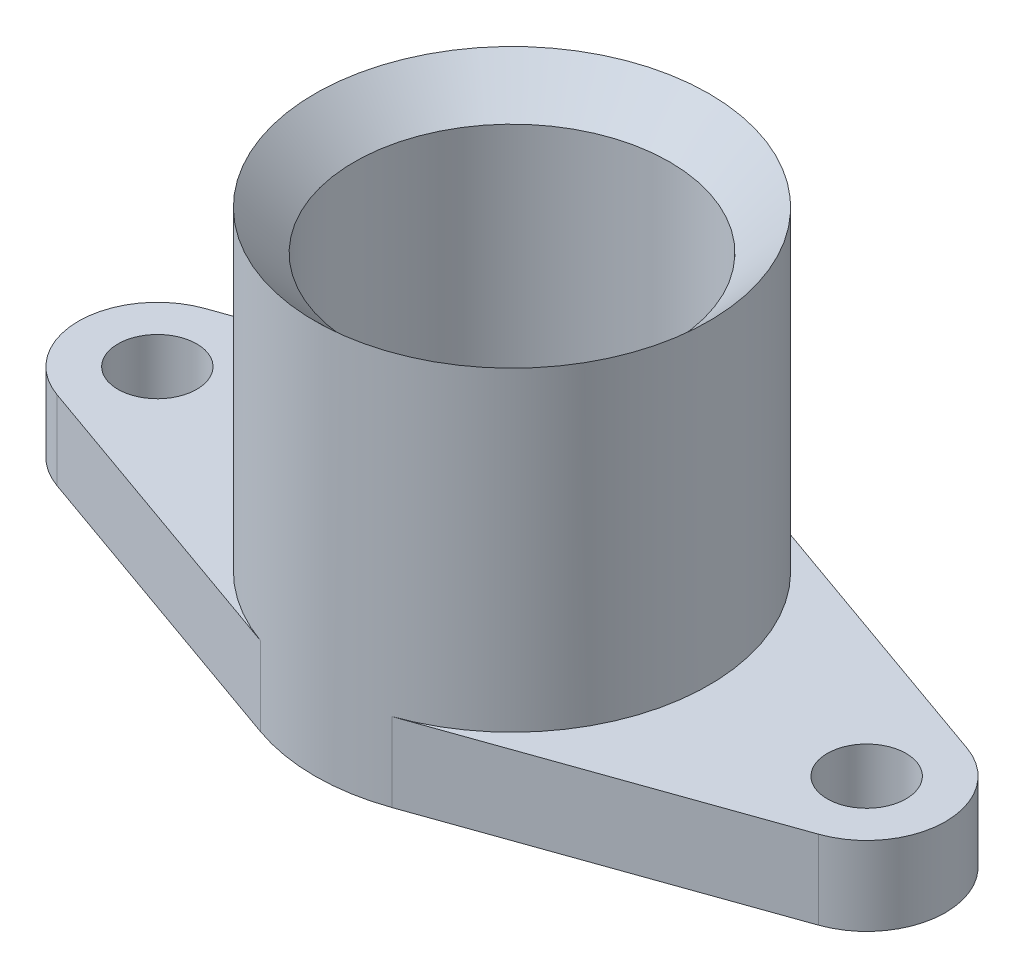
ISO-10303-21;
HEADER;
FILE_DESCRIPTION(('STEP AP214'),'2;1');
FILE_NAME('part.step','',(''),(''),'','','');
FILE_SCHEMA(('AUTOMOTIVE_DESIGN { 1 0 10303 214 1 1 1 1 }'));
ENDSEC;
DATA;
#1=APPLICATION_CONTEXT('core data for automotive mechanical design processes');
#2=APPLICATION_PROTOCOL_DEFINITION('international standard','automotive_design',2000,#1);
#3=PRODUCT_CONTEXT('',#1,'mechanical');
#4=PRODUCT('Part','Part','',(#3));
#5=PRODUCT_RELATED_PRODUCT_CATEGORY('part','',(#4));
#6=PRODUCT_DEFINITION_FORMATION('','',#4);
#7=PRODUCT_DEFINITION_CONTEXT('part definition',#1,'design');
#8=PRODUCT_DEFINITION('design','',#6,#7);
#9=PRODUCT_DEFINITION_SHAPE('','',#8);
#10=(LENGTH_UNIT() NAMED_UNIT(*) SI_UNIT(.MILLI.,.METRE.));
#11=(NAMED_UNIT(*) PLANE_ANGLE_UNIT() SI_UNIT($,.RADIAN.));
#12=(NAMED_UNIT(*) SI_UNIT($,.STERADIAN.) SOLID_ANGLE_UNIT());
#13=UNCERTAINTY_MEASURE_WITH_UNIT(LENGTH_MEASURE(1.E-05),#10,'distance_accuracy_value','');
#14=(GEOMETRIC_REPRESENTATION_CONTEXT(3) GLOBAL_UNCERTAINTY_ASSIGNED_CONTEXT((#13)) GLOBAL_UNIT_ASSIGNED_CONTEXT((#10,
#11,#12)) REPRESENTATION_CONTEXT('',''));
#15=CARTESIAN_POINT('',(0.,0.,0.));
#16=DIRECTION('',(0.,0.,1.));
#17=DIRECTION('',(1.,0.,0.));
#18=AXIS2_PLACEMENT_3D('',#15,#16,#17);
#19=CARTESIAN_POINT('',(0.,-73.0614942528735,0.));
#20=DIRECTION('',(0.,-1.,0.));
#21=DIRECTION('',(0.,0.,-1.));
#22=AXIS2_PLACEMENT_3D('',#19,#20,#21);
#23=CYLINDRICAL_SURFACE('',#22,50.);
#24=CARTESIAN_POINT('',(0.,100.,0.));
#25=DIRECTION('',(0.,-1.,0.));
#26=DIRECTION('',(0.,0.,-1.));
#27=AXIS2_PLACEMENT_3D('',#24,#25,#26);
#28=CIRCLE('',#27,50.);
#29=CARTESIAN_POINT('',(0.,100.,-50.));
#30=VERTEX_POINT('',#29);
#31=EDGE_CURVE('E175',#30,#30,#28,.T.);
#32=ORIENTED_EDGE('',*,*,#31,.T.);
#33=EDGE_LOOP('',(#32));
#34=FACE_BOUND('',#33,.T.);
#35=DIRECTION('',(0.,-1.,0.));
#36=VECTOR('',#35,1.);
#37=CARTESIAN_POINT('',(16.6666666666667,20.,47.1404520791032));
#38=LINE('',#37,#36);
#39=CARTESIAN_POINT('',(16.6666666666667,20.,47.1404520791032));
#40=VERTEX_POINT('',#39);
#41=CARTESIAN_POINT('',(16.6666666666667,0.,47.1404520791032));
#42=VERTEX_POINT('',#41);
#43=EDGE_CURVE('E46',#40,#42,#38,.T.);
#44=ORIENTED_EDGE('',*,*,#43,.F.);
#45=CARTESIAN_POINT('',(0.,20.,0.));
#46=DIRECTION('',(0.,-1.,0.));
#47=DIRECTION('',(0.,0.,-1.));
#48=AXIS2_PLACEMENT_3D('',#45,#46,#47);
#49=CIRCLE('',#48,50.);
#50=CARTESIAN_POINT('',(16.6666666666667,20.,-47.1404520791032));
#51=VERTEX_POINT('',#50);
#52=EDGE_CURVE('E103',#51,#40,#49,.T.);
#53=ORIENTED_EDGE('',*,*,#52,.F.);
#54=DIRECTION('',(0.,-1.,0.));
#55=VECTOR('',#54,1.);
#56=CARTESIAN_POINT('',(16.6666666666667,20.,-47.1404520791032));
#57=LINE('',#56,#55);
#58=CARTESIAN_POINT('',(16.6666666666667,0.,-47.1404520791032));
#59=VERTEX_POINT('',#58);
#60=EDGE_CURVE('E111',#51,#59,#57,.T.);
#61=ORIENTED_EDGE('',*,*,#60,.T.);
#62=CARTESIAN_POINT('',(0.,0.,0.));
#63=DIRECTION('',(0.,-1.,0.));
#64=DIRECTION('',(0.,0.,-1.));
#65=AXIS2_PLACEMENT_3D('',#62,#63,#64);
#66=CIRCLE('',#65,50.);
#67=CARTESIAN_POINT('',(-16.6666666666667,0.,-47.1404520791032));
#68=VERTEX_POINT('',#67);
#69=EDGE_CURVE('E173',#68,#59,#66,.T.);
#70=ORIENTED_EDGE('',*,*,#69,.F.);
#71=DIRECTION('',(0.,-1.,0.));
#72=VECTOR('',#71,1.);
#73=CARTESIAN_POINT('',(-16.6666666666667,20.,-47.1404520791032));
#74=LINE('',#73,#72);
#75=CARTESIAN_POINT('',(-16.6666666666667,20.,-47.1404520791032));
#76=VERTEX_POINT('',#75);
#77=EDGE_CURVE('E164',#76,#68,#74,.T.);
#78=ORIENTED_EDGE('',*,*,#77,.F.);
#79=CARTESIAN_POINT('',(0.,20.,0.));
#80=DIRECTION('',(0.,1.,0.));
#81=DIRECTION('',(0.,0.,-1.));
#82=AXIS2_PLACEMENT_3D('',#79,#80,#81);
#83=CIRCLE('',#82,50.);
#84=CARTESIAN_POINT('',(-16.6666666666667,20.,47.1404520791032));
#85=VERTEX_POINT('',#84);
#86=EDGE_CURVE('E146',#76,#85,#83,.T.);
#87=ORIENTED_EDGE('',*,*,#86,.T.);
#88=DIRECTION('',(0.,-1.,0.));
#89=VECTOR('',#88,1.);
#90=CARTESIAN_POINT('',(-16.6666666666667,20.,47.1404520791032));
#91=LINE('',#90,#89);
#92=CARTESIAN_POINT('',(-16.6666666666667,0.,47.1404520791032));
#93=VERTEX_POINT('',#92);
#94=EDGE_CURVE('E158',#85,#93,#91,.T.);
#95=ORIENTED_EDGE('',*,*,#94,.T.);
#96=EDGE_CURVE('E166',#42,#93,#66,.T.);
#97=ORIENTED_EDGE('',*,*,#96,.F.);
#98=EDGE_LOOP('',(#44,#53,#61,#70,#78,#87,#95,#97));
#99=FACE_BOUND('',#98,.T.);
#100=ADVANCED_FACE('F31',(#34,#99),#23,.T.);
#101=CARTESIAN_POINT('',(-40.,0.,0.));
#102=DIRECTION('',(0.,1.,0.));
#103=DIRECTION('',(0.,0.,1.));
#104=AXIS2_PLACEMENT_3D('',#101,#102,#103);
#105=PLANE('',#104);
#106=CARTESIAN_POINT('',(0.,0.,0.));
#107=DIRECTION('',(0.,-1.,0.));
#108=DIRECTION('',(0.,0.,-1.));
#109=AXIS2_PLACEMENT_3D('',#106,#107,#108);
#110=CIRCLE('',#109,40.);
#111=CARTESIAN_POINT('',(0.,0.,-40.));
#112=VERTEX_POINT('',#111);
#113=EDGE_CURVE('E11',#112,#112,#110,.T.);
#114=ORIENTED_EDGE('',*,*,#113,.F.);
#115=EDGE_LOOP('',(#114));
#116=FACE_BOUND('',#115,.T.);
#117=ORIENTED_EDGE('',*,*,#69,.T.);
#118=DIRECTION('',(-0.942809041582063,0.,-0.333333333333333));
#119=VECTOR('',#118,1.);
#120=CARTESIAN_POINT('',(16.6666666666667,0.,-47.1404520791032));
#121=LINE('',#120,#119);
#122=CARTESIAN_POINT('',(96.6666666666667,0.,-18.8561808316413));
#123=VERTEX_POINT('',#122);
#124=EDGE_CURVE('E114',#123,#59,#121,.T.);
#125=ORIENTED_EDGE('',*,*,#124,.F.);
#126=CARTESIAN_POINT('',(90.,0.,0.));
#127=DIRECTION('',(0.,1.,0.));
#128=DIRECTION('',(0.,0.,-1.));
#129=AXIS2_PLACEMENT_3D('',#126,#127,#128);
#130=CIRCLE('',#129,20.);
#131=CARTESIAN_POINT('',(96.6666666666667,0.,18.8561808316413));
#132=VERTEX_POINT('',#131);
#133=EDGE_CURVE('E123',#132,#123,#130,.T.);
#134=ORIENTED_EDGE('',*,*,#133,.F.);
#135=DIRECTION('',(0.942809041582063,0.,-0.333333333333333));
#136=VECTOR('',#135,1.);
#137=CARTESIAN_POINT('',(16.6666666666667,0.,47.1404520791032));
#138=LINE('',#137,#136);
#139=EDGE_CURVE('E121',#42,#132,#138,.T.);
#140=ORIENTED_EDGE('',*,*,#139,.F.);
#141=ORIENTED_EDGE('',*,*,#96,.T.);
#142=DIRECTION('',(-0.942809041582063,0.,-0.333333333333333));
#143=VECTOR('',#142,1.);
#144=CARTESIAN_POINT('',(-16.6666666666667,0.,47.1404520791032));
#145=LINE('',#144,#143);
#146=CARTESIAN_POINT('',(-96.6666666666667,0.,18.8561808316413));
#147=VERTEX_POINT('',#146);
#148=EDGE_CURVE('E143',#93,#147,#145,.T.);
#149=ORIENTED_EDGE('',*,*,#148,.T.);
#150=CARTESIAN_POINT('',(-90.,0.,0.));
#151=DIRECTION('',(0.,-1.,0.));
#152=DIRECTION('',(0.,0.,-1.));
#153=AXIS2_PLACEMENT_3D('',#150,#151,#152);
#154=CIRCLE('',#153,20.);
#155=CARTESIAN_POINT('',(-96.6666666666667,0.,-18.8561808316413));
#156=VERTEX_POINT('',#155);
#157=EDGE_CURVE('E161',#147,#156,#154,.T.);
#158=ORIENTED_EDGE('',*,*,#157,.T.);
#159=DIRECTION('',(0.942809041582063,0.,-0.333333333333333));
#160=VECTOR('',#159,1.);
#161=CARTESIAN_POINT('',(-16.6666666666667,0.,-47.1404520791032));
#162=LINE('',#161,#160);
#163=EDGE_CURVE('E54',#156,#68,#162,.T.);
#164=ORIENTED_EDGE('',*,*,#163,.T.);
#165=EDGE_LOOP('',(#117,#125,#134,#140,#141,#149,#158,#164));
#166=FACE_BOUND('',#165,.T.);
#167=CARTESIAN_POINT('',(-90.,0.,0.));
#168=DIRECTION('',(0.,-1.,0.));
#169=DIRECTION('',(0.,0.,-1.));
#170=AXIS2_PLACEMENT_3D('',#167,#168,#169);
#171=CIRCLE('',#170,9.99999999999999);
#172=CARTESIAN_POINT('',(-90.,0.,-9.99999999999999));
#173=VERTEX_POINT('',#172);
#174=EDGE_CURVE('E135',#173,#173,#171,.T.);
#175=ORIENTED_EDGE('',*,*,#174,.F.);
#176=EDGE_LOOP('',(#175));
#177=FACE_BOUND('',#176,.T.);
#178=CARTESIAN_POINT('',(90.,0.,0.));
#179=DIRECTION('',(0.,1.,0.));
#180=DIRECTION('',(0.,0.,-1.));
#181=AXIS2_PLACEMENT_3D('',#178,#179,#180);
#182=CIRCLE('',#181,9.99999999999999);
#183=CARTESIAN_POINT('',(90.,0.,-9.99999999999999));
#184=VERTEX_POINT('',#183);
#185=EDGE_CURVE('E126',#184,#184,#182,.T.);
#186=ORIENTED_EDGE('',*,*,#185,.T.);
#187=EDGE_LOOP('',(#186));
#188=FACE_BOUND('',#187,.T.);
#189=ADVANCED_FACE('F33',(#116,#166,#177,#188),#105,.F.);
#190=CARTESIAN_POINT('',(0.,-73.0614942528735,0.));
#191=DIRECTION('',(0.,-1.,0.));
#192=DIRECTION('',(0.,0.,-1.));
#193=AXIS2_PLACEMENT_3D('',#190,#191,#192);
#194=CYLINDRICAL_SURFACE('',#193,40.);
#195=CARTESIAN_POINT('',(0.,90.,0.));
#196=DIRECTION('',(0.,-1.,0.));
#197=DIRECTION('',(0.,0.,-1.));
#198=AXIS2_PLACEMENT_3D('',#195,#196,#197);
#199=CIRCLE('',#198,40.);
#200=CARTESIAN_POINT('',(0.,90.,-40.));
#201=VERTEX_POINT('',#200);
#202=EDGE_CURVE('E39',#201,#201,#199,.T.);
#203=ORIENTED_EDGE('',*,*,#202,.F.);
#204=EDGE_LOOP('',(#203));
#205=FACE_BOUND('',#204,.T.);
#206=ORIENTED_EDGE('',*,*,#113,.T.);
#207=EDGE_LOOP('',(#206));
#208=FACE_BOUND('',#207,.T.);
#209=ADVANCED_FACE('F182',(#205,#208),#194,.F.);
#210=CARTESIAN_POINT('',(0.,90.,0.));
#211=DIRECTION('',(0.,1.,0.));
#212=DIRECTION('',(0.,0.,1.));
#213=AXIS2_PLACEMENT_3D('',#210,#211,#212);
#214=CONICAL_SURFACE('',#213,40.,0.785398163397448);
#215=ORIENTED_EDGE('',*,*,#31,.F.);
#216=EDGE_LOOP('',(#215));
#217=FACE_BOUND('',#216,.T.);
#218=ORIENTED_EDGE('',*,*,#202,.T.);
#219=EDGE_LOOP('',(#218));
#220=FACE_BOUND('',#219,.T.);
#221=ADVANCED_FACE('F180',(#217,#220),#214,.F.);
#222=CARTESIAN_POINT('',(-16.6666666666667,20.,-47.1404520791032));
#223=DIRECTION('',(-0.333333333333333,0.,-0.942809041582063));
#224=DIRECTION('',(-0.942809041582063,0.,0.333333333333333));
#225=AXIS2_PLACEMENT_3D('',#222,#223,#224);
#226=PLANE('',#225);
#227=ORIENTED_EDGE('',*,*,#163,.F.);
#228=DIRECTION('',(0.,-1.,0.));
#229=VECTOR('',#228,1.);
#230=CARTESIAN_POINT('',(-96.6666666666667,20.,-18.8561808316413));
#231=LINE('',#230,#229);
#232=CARTESIAN_POINT('',(-96.6666666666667,20.,-18.8561808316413));
#233=VERTEX_POINT('',#232);
#234=EDGE_CURVE('E167',#233,#156,#231,.T.);
#235=ORIENTED_EDGE('',*,*,#234,.F.);
#236=DIRECTION('',(0.942809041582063,0.,-0.333333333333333));
#237=VECTOR('',#236,1.);
#238=CARTESIAN_POINT('',(-16.6666666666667,20.,-47.1404520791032));
#239=LINE('',#238,#237);
#240=EDGE_CURVE('E155',#233,#76,#239,.T.);
#241=ORIENTED_EDGE('',*,*,#240,.T.);
#242=ORIENTED_EDGE('',*,*,#77,.T.);
#243=EDGE_LOOP('',(#227,#235,#241,#242));
#244=FACE_BOUND('',#243,.T.);
#245=ADVANCED_FACE('F222',(#244),#226,.T.);
#246=CARTESIAN_POINT('',(-90.,20.,0.));
#247=DIRECTION('',(0.,-1.,0.));
#248=DIRECTION('',(0.,0.,-1.));
#249=AXIS2_PLACEMENT_3D('',#246,#247,#248);
#250=CYLINDRICAL_SURFACE('',#249,20.);
#251=ORIENTED_EDGE('',*,*,#157,.F.);
#252=DIRECTION('',(0.,-1.,0.));
#253=VECTOR('',#252,1.);
#254=CARTESIAN_POINT('',(-96.6666666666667,20.,18.8561808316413));
#255=LINE('',#254,#253);
#256=CARTESIAN_POINT('',(-96.6666666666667,20.,18.8561808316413));
#257=VERTEX_POINT('',#256);
#258=EDGE_CURVE('E169',#257,#147,#255,.T.);
#259=ORIENTED_EDGE('',*,*,#258,.F.);
#260=CARTESIAN_POINT('',(-90.,20.,0.));
#261=DIRECTION('',(0.,-1.,0.));
#262=DIRECTION('',(0.,0.,-1.));
#263=AXIS2_PLACEMENT_3D('',#260,#261,#262);
#264=CIRCLE('',#263,20.);
#265=EDGE_CURVE('E152',#257,#233,#264,.T.);
#266=ORIENTED_EDGE('',*,*,#265,.T.);
#267=ORIENTED_EDGE('',*,*,#234,.T.);
#268=EDGE_LOOP('',(#251,#259,#266,#267));
#269=FACE_BOUND('',#268,.T.);
#270=ADVANCED_FACE('F227',(#269),#250,.T.);
#271=CARTESIAN_POINT('',(-16.6666666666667,20.,47.1404520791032));
#272=DIRECTION('',(-0.333333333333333,0.,0.942809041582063));
#273=DIRECTION('',(0.942809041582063,0.,0.333333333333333));
#274=AXIS2_PLACEMENT_3D('',#271,#272,#273);
#275=PLANE('',#274);
#276=ORIENTED_EDGE('',*,*,#148,.F.);
#277=ORIENTED_EDGE('',*,*,#94,.F.);
#278=DIRECTION('',(-0.942809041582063,0.,-0.333333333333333));
#279=VECTOR('',#278,1.);
#280=CARTESIAN_POINT('',(-16.6666666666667,20.,47.1404520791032));
#281=LINE('',#280,#279);
#282=EDGE_CURVE('E149',#85,#257,#281,.T.);
#283=ORIENTED_EDGE('',*,*,#282,.T.);
#284=ORIENTED_EDGE('',*,*,#258,.T.);
#285=EDGE_LOOP('',(#276,#277,#283,#284));
#286=FACE_BOUND('',#285,.T.);
#287=ADVANCED_FACE('F219',(#286),#275,.T.);
#288=CARTESIAN_POINT('',(0.,20.,0.));
#289=DIRECTION('',(0.,-1.,0.));
#290=DIRECTION('',(0.,0.,-1.));
#291=AXIS2_PLACEMENT_3D('',#288,#289,#290);
#292=PLANE('',#291);
#293=CARTESIAN_POINT('',(-90.,20.,0.));
#294=DIRECTION('',(0.,-1.,0.));
#295=DIRECTION('',(0.,0.,-1.));
#296=AXIS2_PLACEMENT_3D('',#293,#294,#295);
#297=CIRCLE('',#296,9.99999999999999);
#298=CARTESIAN_POINT('',(-90.,20.,-9.99999999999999));
#299=VERTEX_POINT('',#298);
#300=EDGE_CURVE('E140',#299,#299,#297,.T.);
#301=ORIENTED_EDGE('',*,*,#300,.T.);
#302=EDGE_LOOP('',(#301));
#303=FACE_BOUND('',#302,.T.);
#304=ORIENTED_EDGE('',*,*,#86,.F.);
#305=ORIENTED_EDGE('',*,*,#240,.F.);
#306=ORIENTED_EDGE('',*,*,#265,.F.);
#307=ORIENTED_EDGE('',*,*,#282,.F.);
#308=EDGE_LOOP('',(#304,#305,#306,#307));
#309=FACE_BOUND('',#308,.T.);
#310=ADVANCED_FACE('F208',(#303,#309),#292,.F.);
#311=CARTESIAN_POINT('',(-90.,20.,0.));
#312=DIRECTION('',(0.,-1.,0.));
#313=DIRECTION('',(0.,0.,-1.));
#314=AXIS2_PLACEMENT_3D('',#311,#312,#313);
#315=CYLINDRICAL_SURFACE('',#314,9.99999999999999);
#316=ORIENTED_EDGE('',*,*,#300,.F.);
#317=EDGE_LOOP('',(#316));
#318=FACE_BOUND('',#317,.T.);
#319=ORIENTED_EDGE('',*,*,#174,.T.);
#320=EDGE_LOOP('',(#319));
#321=FACE_BOUND('',#320,.T.);
#322=ADVANCED_FACE('F200',(#318,#321),#315,.F.);
#323=CARTESIAN_POINT('',(0.,20.,0.));
#324=DIRECTION('',(0.,-1.,0.));
#325=DIRECTION('',(0.,0.,-1.));
#326=AXIS2_PLACEMENT_3D('',#323,#324,#325);
#327=PLANE('',#326);
#328=ORIENTED_EDGE('',*,*,#52,.T.);
#329=DIRECTION('',(0.942809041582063,0.,-0.333333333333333));
#330=VECTOR('',#329,1.);
#331=CARTESIAN_POINT('',(16.6666666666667,20.,47.1404520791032));
#332=LINE('',#331,#330);
#333=CARTESIAN_POINT('',(96.6666666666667,20.,18.8561808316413));
#334=VERTEX_POINT('',#333);
#335=EDGE_CURVE('E118',#40,#334,#332,.T.);
#336=ORIENTED_EDGE('',*,*,#335,.T.);
#337=CARTESIAN_POINT('',(90.,20.,0.));
#338=DIRECTION('',(0.,1.,0.));
#339=DIRECTION('',(0.,0.,-1.));
#340=AXIS2_PLACEMENT_3D('',#337,#338,#339);
#341=CIRCLE('',#340,20.);
#342=CARTESIAN_POINT('',(96.6666666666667,20.,-18.8561808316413));
#343=VERTEX_POINT('',#342);
#344=EDGE_CURVE('E105',#334,#343,#341,.T.);
#345=ORIENTED_EDGE('',*,*,#344,.T.);
#346=DIRECTION('',(-0.942809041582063,0.,-0.333333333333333));
#347=VECTOR('',#346,1.);
#348=CARTESIAN_POINT('',(16.6666666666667,20.,-47.1404520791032));
#349=LINE('',#348,#347);
#350=EDGE_CURVE('E98',#343,#51,#349,.T.);
#351=ORIENTED_EDGE('',*,*,#350,.T.);
#352=EDGE_LOOP('',(#328,#336,#345,#351));
#353=FACE_BOUND('',#352,.T.);
#354=CARTESIAN_POINT('',(90.,20.,0.));
#355=DIRECTION('',(0.,1.,0.));
#356=DIRECTION('',(0.,0.,-1.));
#357=AXIS2_PLACEMENT_3D('',#354,#355,#356);
#358=CIRCLE('',#357,9.99999999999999);
#359=CARTESIAN_POINT('',(90.,20.,-9.99999999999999));
#360=VERTEX_POINT('',#359);
#361=EDGE_CURVE('E132',#360,#360,#358,.T.);
#362=ORIENTED_EDGE('',*,*,#361,.F.);
#363=EDGE_LOOP('',(#362));
#364=FACE_BOUND('',#363,.T.);
#365=ADVANCED_FACE('F100',(#353,#364),#327,.F.);
#366=CARTESIAN_POINT('',(16.6666666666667,20.,47.1404520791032));
#367=DIRECTION('',(-0.333333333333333,0.,-0.942809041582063));
#368=DIRECTION('',(-0.942809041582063,0.,0.333333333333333));
#369=AXIS2_PLACEMENT_3D('',#366,#367,#368);
#370=PLANE('',#369);
#371=ORIENTED_EDGE('',*,*,#139,.T.);
#372=DIRECTION('',(0.,-1.,0.));
#373=VECTOR('',#372,1.);
#374=CARTESIAN_POINT('',(96.6666666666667,20.,18.8561808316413));
#375=LINE('',#374,#373);
#376=EDGE_CURVE('E136',#334,#132,#375,.T.);
#377=ORIENTED_EDGE('',*,*,#376,.F.);
#378=ORIENTED_EDGE('',*,*,#335,.F.);
#379=ORIENTED_EDGE('',*,*,#43,.T.);
#380=EDGE_LOOP('',(#371,#377,#378,#379));
#381=FACE_BOUND('',#380,.T.);
#382=ADVANCED_FACE('F199',(#381),#370,.F.);
#383=CARTESIAN_POINT('',(90.,20.,0.));
#384=DIRECTION('',(0.,-1.,0.));
#385=DIRECTION('',(0.,0.,-1.));
#386=AXIS2_PLACEMENT_3D('',#383,#384,#385);
#387=CYLINDRICAL_SURFACE('',#386,20.);
#388=ORIENTED_EDGE('',*,*,#133,.T.);
#389=DIRECTION('',(0.,-1.,0.));
#390=VECTOR('',#389,1.);
#391=CARTESIAN_POINT('',(96.6666666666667,20.,-18.8561808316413));
#392=LINE('',#391,#390);
#393=EDGE_CURVE('E117',#343,#123,#392,.T.);
#394=ORIENTED_EDGE('',*,*,#393,.F.);
#395=ORIENTED_EDGE('',*,*,#344,.F.);
#396=ORIENTED_EDGE('',*,*,#376,.T.);
#397=EDGE_LOOP('',(#388,#394,#395,#396));
#398=FACE_BOUND('',#397,.T.);
#399=ADVANCED_FACE('F206',(#398),#387,.T.);
#400=CARTESIAN_POINT('',(16.6666666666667,20.,-47.1404520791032));
#401=DIRECTION('',(-0.333333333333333,0.,0.942809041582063));
#402=DIRECTION('',(0.942809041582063,0.,0.333333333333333));
#403=AXIS2_PLACEMENT_3D('',#400,#401,#402);
#404=PLANE('',#403);
#405=ORIENTED_EDGE('',*,*,#124,.T.);
#406=ORIENTED_EDGE('',*,*,#60,.F.);
#407=ORIENTED_EDGE('',*,*,#350,.F.);
#408=ORIENTED_EDGE('',*,*,#393,.T.);
#409=EDGE_LOOP('',(#405,#406,#407,#408));
#410=FACE_BOUND('',#409,.T.);
#411=ADVANCED_FACE('F112',(#410),#404,.F.);
#412=CARTESIAN_POINT('',(90.,20.,0.));
#413=DIRECTION('',(0.,-1.,0.));
#414=DIRECTION('',(0.,0.,-1.));
#415=AXIS2_PLACEMENT_3D('',#412,#413,#414);
#416=CYLINDRICAL_SURFACE('',#415,9.99999999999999);
#417=ORIENTED_EDGE('',*,*,#361,.T.);
#418=EDGE_LOOP('',(#417));
#419=FACE_BOUND('',#418,.T.);
#420=ORIENTED_EDGE('',*,*,#185,.F.);
#421=EDGE_LOOP('',(#420));
#422=FACE_BOUND('',#421,.T.);
#423=ADVANCED_FACE('F197',(#419,#422),#416,.F.);
#424=CLOSED_SHELL('',(#100,#189,#209,#221,#245,#270,#287,#310,#322,#365,#382,#399,#411,#423));
#425=MANIFOLD_SOLID_BREP('B2',#424);
#426=ADVANCED_BREP_SHAPE_REPRESENTATION('',(#18,#425),#14);
#427=SHAPE_DEFINITION_REPRESENTATION(#9,#426);
ENDSEC;
END-ISO-10303-21;
